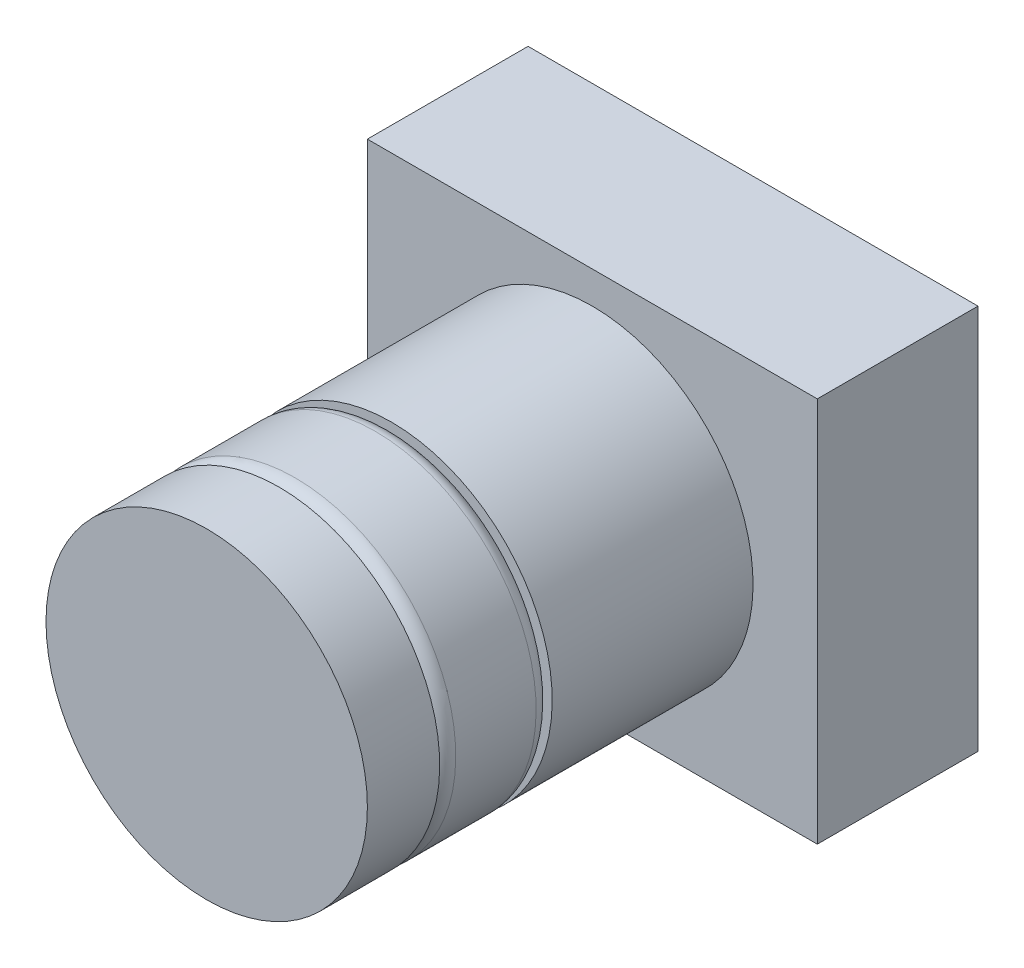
ISO-10303-21;
HEADER;
FILE_DESCRIPTION(('STEP AP214'),'2;1');
FILE_NAME('part.step','',(''),(''),'','','');
FILE_SCHEMA(('AUTOMOTIVE_DESIGN { 1 0 10303 214 1 1 1 1 }'));
ENDSEC;
DATA;
#1=APPLICATION_CONTEXT('core data for automotive mechanical design processes');
#2=APPLICATION_PROTOCOL_DEFINITION('international standard','automotive_design',2000,#1);
#3=PRODUCT_CONTEXT('',#1,'mechanical');
#4=PRODUCT('Part','Part','',(#3));
#5=PRODUCT_RELATED_PRODUCT_CATEGORY('part','',(#4));
#6=PRODUCT_DEFINITION_FORMATION('','',#4);
#7=PRODUCT_DEFINITION_CONTEXT('part definition',#1,'design');
#8=PRODUCT_DEFINITION('design','',#6,#7);
#9=PRODUCT_DEFINITION_SHAPE('','',#8);
#10=(LENGTH_UNIT() NAMED_UNIT(*) SI_UNIT(.MILLI.,.METRE.));
#11=(NAMED_UNIT(*) PLANE_ANGLE_UNIT() SI_UNIT($,.RADIAN.));
#12=(NAMED_UNIT(*) SI_UNIT($,.STERADIAN.) SOLID_ANGLE_UNIT());
#13=UNCERTAINTY_MEASURE_WITH_UNIT(LENGTH_MEASURE(1.E-05),#10,'distance_accuracy_value','');
#14=(GEOMETRIC_REPRESENTATION_CONTEXT(3) GLOBAL_UNCERTAINTY_ASSIGNED_CONTEXT((#13)) GLOBAL_UNIT_ASSIGNED_CONTEXT((#10,
#11,#12)) REPRESENTATION_CONTEXT('',''));
#15=CARTESIAN_POINT('',(0.,0.,0.));
#16=DIRECTION('',(0.,0.,1.));
#17=DIRECTION('',(1.,0.,0.));
#18=AXIS2_PLACEMENT_3D('',#15,#16,#17);
#19=CARTESIAN_POINT('',(0.,0.,0.));
#20=DIRECTION('',(0.,0.,-1.));
#21=DIRECTION('',(0.,1.,0.));
#22=AXIS2_PLACEMENT_3D('',#19,#20,#21);
#23=PLANE('',#22);
#24=DIRECTION('',(0.,-1.,0.));
#25=VECTOR('',#24,1.);
#26=CARTESIAN_POINT('',(7.,6.,0.));
#27=LINE('',#26,#25);
#28=CARTESIAN_POINT('',(7.,6.,0.));
#29=VERTEX_POINT('',#28);
#30=CARTESIAN_POINT('',(7.,-6.,0.));
#31=VERTEX_POINT('',#30);
#32=EDGE_CURVE('E95',#29,#31,#27,.T.);
#33=ORIENTED_EDGE('',*,*,#32,.F.);
#34=DIRECTION('',(-1.,0.,0.));
#35=VECTOR('',#34,1.);
#36=CARTESIAN_POINT('',(0.,6.,0.));
#37=LINE('',#36,#35);
#38=CARTESIAN_POINT('',(-7.,6.,0.));
#39=VERTEX_POINT('',#38);
#40=EDGE_CURVE('E75',#39,#29,#37,.F.);
#41=ORIENTED_EDGE('',*,*,#40,.F.);
#42=DIRECTION('',(0.,1.,0.));
#43=VECTOR('',#42,1.);
#44=CARTESIAN_POINT('',(-7.,6.,0.));
#45=LINE('',#44,#43);
#46=CARTESIAN_POINT('',(-7.,-6.,0.));
#47=VERTEX_POINT('',#46);
#48=EDGE_CURVE('E61',#47,#39,#45,.T.);
#49=ORIENTED_EDGE('',*,*,#48,.F.);
#50=DIRECTION('',(-1.,0.,0.));
#51=VECTOR('',#50,1.);
#52=CARTESIAN_POINT('',(7.,-6.,0.));
#53=LINE('',#52,#51);
#54=EDGE_CURVE('E73',#47,#31,#53,.F.);
#55=ORIENTED_EDGE('',*,*,#54,.T.);
#56=EDGE_LOOP('',(#33,#41,#49,#55));
#57=FACE_BOUND('',#56,.T.);
#58=CARTESIAN_POINT('',(0.,0.,0.));
#59=DIRECTION('',(0.,0.,-1.));
#60=DIRECTION('',(0.,1.,0.));
#61=AXIS2_PLACEMENT_3D('',#58,#59,#60);
#62=CIRCLE('',#61,5.);
#63=CARTESIAN_POINT('',(0.,5.,0.));
#64=VERTEX_POINT('',#63);
#65=EDGE_CURVE('E25',#64,#64,#62,.T.);
#66=ORIENTED_EDGE('',*,*,#65,.T.);
#67=EDGE_LOOP('',(#66));
#68=FACE_BOUND('',#67,.T.);
#69=ADVANCED_FACE('F16',(#57,#68),#23,.F.);
#70=CARTESIAN_POINT('',(7.,6.,0.));
#71=DIRECTION('',(-1.,0.,0.));
#72=DIRECTION('',(0.,-1.,0.));
#73=AXIS2_PLACEMENT_3D('',#70,#71,#72);
#74=PLANE('',#73);
#75=DIRECTION('',(0.,-1.,0.));
#76=VECTOR('',#75,1.);
#77=CARTESIAN_POINT('',(7.,6.,-5.));
#78=LINE('',#77,#76);
#79=CARTESIAN_POINT('',(7.,6.,-5.));
#80=VERTEX_POINT('',#79);
#81=CARTESIAN_POINT('',(7.,-6.,-5.));
#82=VERTEX_POINT('',#81);
#83=EDGE_CURVE('E32',#80,#82,#78,.T.);
#84=ORIENTED_EDGE('',*,*,#83,.F.);
#85=DIRECTION('',(0.,0.,1.));
#86=VECTOR('',#85,1.);
#87=CARTESIAN_POINT('',(7.,6.,0.));
#88=LINE('',#87,#86);
#89=EDGE_CURVE('E102',#80,#29,#88,.T.);
#90=ORIENTED_EDGE('',*,*,#89,.T.);
#91=ORIENTED_EDGE('',*,*,#32,.T.);
#92=DIRECTION('',(0.,0.,-1.));
#93=VECTOR('',#92,1.);
#94=CARTESIAN_POINT('',(7.,-6.,0.));
#95=LINE('',#94,#93);
#96=EDGE_CURVE('E79',#31,#82,#95,.T.);
#97=ORIENTED_EDGE('',*,*,#96,.T.);
#98=EDGE_LOOP('',(#84,#90,#91,#97));
#99=FACE_BOUND('',#98,.T.);
#100=ADVANCED_FACE('F133',(#99),#74,.F.);
#101=CARTESIAN_POINT('',(-7.,6.,0.));
#102=DIRECTION('',(1.,0.,0.));
#103=DIRECTION('',(0.,1.,0.));
#104=AXIS2_PLACEMENT_3D('',#101,#102,#103);
#105=PLANE('',#104);
#106=ORIENTED_EDGE('',*,*,#48,.T.);
#107=DIRECTION('',(0.,0.,-1.));
#108=VECTOR('',#107,1.);
#109=CARTESIAN_POINT('',(-7.,6.,0.));
#110=LINE('',#109,#108);
#111=CARTESIAN_POINT('',(-7.,6.,-5.));
#112=VERTEX_POINT('',#111);
#113=EDGE_CURVE('E92',#39,#112,#110,.T.);
#114=ORIENTED_EDGE('',*,*,#113,.T.);
#115=DIRECTION('',(0.,1.,0.));
#116=VECTOR('',#115,1.);
#117=CARTESIAN_POINT('',(-7.,6.,-5.));
#118=LINE('',#117,#116);
#119=CARTESIAN_POINT('',(-7.,-6.,-5.));
#120=VERTEX_POINT('',#119);
#121=EDGE_CURVE('E63',#120,#112,#118,.T.);
#122=ORIENTED_EDGE('',*,*,#121,.F.);
#123=DIRECTION('',(0.,0.,1.));
#124=VECTOR('',#123,1.);
#125=CARTESIAN_POINT('',(-7.,-6.,0.));
#126=LINE('',#125,#124);
#127=EDGE_CURVE('E57',#120,#47,#126,.T.);
#128=ORIENTED_EDGE('',*,*,#127,.T.);
#129=EDGE_LOOP('',(#106,#114,#122,#128));
#130=FACE_BOUND('',#129,.T.);
#131=ADVANCED_FACE('F59',(#130),#105,.F.);
#132=CARTESIAN_POINT('',(7.,-6.,0.));
#133=DIRECTION('',(0.,1.,0.));
#134=DIRECTION('',(-1.,0.,0.));
#135=AXIS2_PLACEMENT_3D('',#132,#133,#134);
#136=PLANE('',#135);
#137=ORIENTED_EDGE('',*,*,#96,.F.);
#138=ORIENTED_EDGE('',*,*,#54,.F.);
#139=ORIENTED_EDGE('',*,*,#127,.F.);
#140=DIRECTION('',(-1.,0.,0.));
#141=VECTOR('',#140,1.);
#142=CARTESIAN_POINT('',(7.,-6.,-5.));
#143=LINE('',#142,#141);
#144=EDGE_CURVE('E189',#82,#120,#143,.T.);
#145=ORIENTED_EDGE('',*,*,#144,.F.);
#146=EDGE_LOOP('',(#137,#138,#139,#145));
#147=FACE_BOUND('',#146,.T.);
#148=ADVANCED_FACE('F78',(#147),#136,.F.);
#149=CARTESIAN_POINT('',(7.,6.,0.));
#150=DIRECTION('',(0.,-1.,0.));
#151=DIRECTION('',(1.,0.,0.));
#152=AXIS2_PLACEMENT_3D('',#149,#150,#151);
#153=PLANE('',#152);
#154=ORIENTED_EDGE('',*,*,#89,.F.);
#155=DIRECTION('',(1.,0.,0.));
#156=VECTOR('',#155,1.);
#157=CARTESIAN_POINT('',(7.,6.,-5.));
#158=LINE('',#157,#156);
#159=EDGE_CURVE('E82',#112,#80,#158,.T.);
#160=ORIENTED_EDGE('',*,*,#159,.F.);
#161=ORIENTED_EDGE('',*,*,#113,.F.);
#162=ORIENTED_EDGE('',*,*,#40,.T.);
#163=EDGE_LOOP('',(#154,#160,#161,#162));
#164=FACE_BOUND('',#163,.T.);
#165=ADVANCED_FACE('F143',(#164),#153,.F.);
#166=CARTESIAN_POINT('',(0.,0.,-5.));
#167=DIRECTION('',(0.,0.,-1.));
#168=DIRECTION('',(0.,1.,0.));
#169=AXIS2_PLACEMENT_3D('',#166,#167,#168);
#170=PLANE('',#169);
#171=ORIENTED_EDGE('',*,*,#159,.T.);
#172=ORIENTED_EDGE('',*,*,#83,.T.);
#173=ORIENTED_EDGE('',*,*,#144,.T.);
#174=ORIENTED_EDGE('',*,*,#121,.T.);
#175=EDGE_LOOP('',(#171,#172,#173,#174));
#176=FACE_BOUND('',#175,.T.);
#177=ADVANCED_FACE('F127',(#176),#170,.T.);
#178=CARTESIAN_POINT('',(-5.,0.,6.25));
#179=DIRECTION('',(0.,0.,1.));
#180=DIRECTION('',(0.,-1.,0.));
#181=AXIS2_PLACEMENT_3D('',#178,#179,#180);
#182=PLANE('',#181);
#183=CARTESIAN_POINT('',(0.,0.,6.25));
#184=DIRECTION('',(0.,0.,-1.));
#185=DIRECTION('',(0.,1.,0.));
#186=AXIS2_PLACEMENT_3D('',#183,#184,#185);
#187=CIRCLE('',#186,4.5);
#188=CARTESIAN_POINT('',(0.,4.49999999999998,6.25000000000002));
#189=VERTEX_POINT('',#188);
#190=EDGE_CURVE('E174',#189,#189,#187,.T.);
#191=ORIENTED_EDGE('',*,*,#190,.T.);
#192=EDGE_LOOP('',(#191));
#193=FACE_BOUND('',#192,.T.);
#194=CARTESIAN_POINT('',(0.,0.,6.25));
#195=DIRECTION('',(0.,0.,-1.));
#196=DIRECTION('',(0.,1.,0.));
#197=AXIS2_PLACEMENT_3D('',#194,#195,#196);
#198=CIRCLE('',#197,5.);
#199=CARTESIAN_POINT('',(0.,4.99999999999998,6.25000000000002));
#200=VERTEX_POINT('',#199);
#201=EDGE_CURVE('E186',#200,#200,#198,.T.);
#202=ORIENTED_EDGE('',*,*,#201,.F.);
#203=EDGE_LOOP('',(#202));
#204=FACE_BOUND('',#203,.T.);
#205=ADVANCED_FACE('F116',(#193,#204),#182,.T.);
#206=CARTESIAN_POINT('',(0.,0.,12.));
#207=DIRECTION('',(0.,0.,-1.));
#208=DIRECTION('',(0.,1.,0.));
#209=AXIS2_PLACEMENT_3D('',#206,#207,#208);
#210=CYLINDRICAL_SURFACE('',#209,5.);
#211=ORIENTED_EDGE('',*,*,#201,.T.);
#212=EDGE_LOOP('',(#211));
#213=FACE_BOUND('',#212,.T.);
#214=ORIENTED_EDGE('',*,*,#65,.F.);
#215=EDGE_LOOP('',(#214));
#216=FACE_BOUND('',#215,.T.);
#217=ADVANCED_FACE('F113',(#213,#216),#210,.T.);
#218=CARTESIAN_POINT('',(0.,0.,9.25));
#219=DIRECTION('',(0.,0.,-1.));
#220=DIRECTION('',(0.,1.,0.));
#221=AXIS2_PLACEMENT_3D('',#218,#219,#220);
#222=TOROIDAL_SURFACE('',#221,4.5,0.5);
#223=CARTESIAN_POINT('',(0.,0.,9.75));
#224=DIRECTION('',(0.,0.,-1.));
#225=DIRECTION('',(0.,1.,0.));
#226=AXIS2_PLACEMENT_3D('',#223,#224,#225);
#227=CIRCLE('',#226,4.5);
#228=CARTESIAN_POINT('',(0.,4.49999999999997,9.75000000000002));
#229=VERTEX_POINT('',#228);
#230=EDGE_CURVE('E11',#229,#229,#227,.T.);
#231=ORIENTED_EDGE('',*,*,#230,.T.);
#232=EDGE_LOOP('',(#231));
#233=FACE_BOUND('',#232,.T.);
#234=CARTESIAN_POINT('',(0.,0.,9.25));
#235=DIRECTION('',(0.,0.,-1.));
#236=DIRECTION('',(0.,1.,0.));
#237=AXIS2_PLACEMENT_3D('',#234,#235,#236);
#238=CIRCLE('',#237,5.);
#239=CARTESIAN_POINT('',(0.,4.99999999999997,9.25000000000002));
#240=VERTEX_POINT('',#239);
#241=EDGE_CURVE('E179',#240,#240,#238,.T.);
#242=ORIENTED_EDGE('',*,*,#241,.F.);
#243=EDGE_LOOP('',(#242));
#244=FACE_BOUND('',#243,.T.);
#245=ADVANCED_FACE('F115',(#233,#244),#222,.T.);
#246=CARTESIAN_POINT('',(0.,0.,-5.));
#247=DIRECTION('',(0.,0.,-1.));
#248=DIRECTION('',(0.,1.,0.));
#249=AXIS2_PLACEMENT_3D('',#246,#247,#248);
#250=CYLINDRICAL_SURFACE('',#249,5.);
#251=ORIENTED_EDGE('',*,*,#241,.T.);
#252=EDGE_LOOP('',(#251));
#253=FACE_BOUND('',#252,.T.);
#254=CARTESIAN_POINT('',(0.,0.,6.75));
#255=DIRECTION('',(0.,0.,-1.));
#256=DIRECTION('',(0.,1.,0.));
#257=AXIS2_PLACEMENT_3D('',#254,#255,#256);
#258=CIRCLE('',#257,5.);
#259=CARTESIAN_POINT('',(0.,4.99999999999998,6.75000000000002));
#260=VERTEX_POINT('',#259);
#261=EDGE_CURVE('E171',#260,#260,#258,.T.);
#262=ORIENTED_EDGE('',*,*,#261,.F.);
#263=EDGE_LOOP('',(#262));
#264=FACE_BOUND('',#263,.T.);
#265=ADVANCED_FACE('F124',(#253,#264),#250,.T.);
#266=CARTESIAN_POINT('',(0.,0.,6.75));
#267=DIRECTION('',(0.,0.,-1.));
#268=DIRECTION('',(0.,1.,0.));
#269=AXIS2_PLACEMENT_3D('',#266,#267,#268);
#270=TOROIDAL_SURFACE('',#269,4.5,0.5);
#271=ORIENTED_EDGE('',*,*,#261,.T.);
#272=EDGE_LOOP('',(#271));
#273=FACE_BOUND('',#272,.T.);
#274=ORIENTED_EDGE('',*,*,#190,.F.);
#275=EDGE_LOOP('',(#274));
#276=FACE_BOUND('',#275,.T.);
#277=ADVANCED_FACE('F160',(#273,#276),#270,.T.);
#278=CARTESIAN_POINT('',(0.,0.,12.));
#279=DIRECTION('',(0.,0.,1.));
#280=DIRECTION('',(0.,-1.,0.));
#281=AXIS2_PLACEMENT_3D('',#278,#279,#280);
#282=PLANE('',#281);
#283=CARTESIAN_POINT('',(0.,0.,12.));
#284=DIRECTION('',(0.,0.,1.));
#285=DIRECTION('',(0.,-1.,0.));
#286=AXIS2_PLACEMENT_3D('',#283,#284,#285);
#287=CIRCLE('',#286,5.);
#288=CARTESIAN_POINT('',(0.,-5.00000000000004,12.));
#289=VERTEX_POINT('',#288);
#290=EDGE_CURVE('E105',#289,#289,#287,.F.);
#291=ORIENTED_EDGE('',*,*,#290,.F.);
#292=EDGE_LOOP('',(#291));
#293=FACE_BOUND('',#292,.T.);
#294=ADVANCED_FACE('F18',(#293),#282,.T.);
#295=CARTESIAN_POINT('',(0.,0.,12.));
#296=DIRECTION('',(0.,0.,-1.));
#297=DIRECTION('',(0.,1.,0.));
#298=AXIS2_PLACEMENT_3D('',#295,#296,#297);
#299=CYLINDRICAL_SURFACE('',#298,5.);
#300=CARTESIAN_POINT('',(0.,0.,9.75));
#301=DIRECTION('',(0.,0.,-1.));
#302=DIRECTION('',(0.,1.,0.));
#303=AXIS2_PLACEMENT_3D('',#300,#301,#302);
#304=CIRCLE('',#303,5.);
#305=CARTESIAN_POINT('',(0.,4.99999999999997,9.75000000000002));
#306=VERTEX_POINT('',#305);
#307=EDGE_CURVE('E185',#306,#306,#304,.T.);
#308=ORIENTED_EDGE('',*,*,#307,.F.);
#309=EDGE_LOOP('',(#308));
#310=FACE_BOUND('',#309,.T.);
#311=ORIENTED_EDGE('',*,*,#290,.T.);
#312=EDGE_LOOP('',(#311));
#313=FACE_BOUND('',#312,.T.);
#314=ADVANCED_FACE('F155',(#310,#313),#299,.T.);
#315=CARTESIAN_POINT('',(-5.,0.,9.75));
#316=DIRECTION('',(0.,0.,-1.));
#317=DIRECTION('',(0.,1.,0.));
#318=AXIS2_PLACEMENT_3D('',#315,#316,#317);
#319=PLANE('',#318);
#320=ORIENTED_EDGE('',*,*,#230,.F.);
#321=EDGE_LOOP('',(#320));
#322=FACE_BOUND('',#321,.T.);
#323=ORIENTED_EDGE('',*,*,#307,.T.);
#324=EDGE_LOOP('',(#323));
#325=FACE_BOUND('',#324,.T.);
#326=ADVANCED_FACE('F153',(#322,#325),#319,.T.);
#327=CLOSED_SHELL('',(#69,#100,#131,#148,#165,#177,#205,#217,#245,#265,#277,#294,#314,#326));
#328=MANIFOLD_SOLID_BREP('B1',#327);
#329=ADVANCED_BREP_SHAPE_REPRESENTATION('',(#18,#328),#14);
#330=SHAPE_DEFINITION_REPRESENTATION(#9,#329);
ENDSEC;
END-ISO-10303-21;
